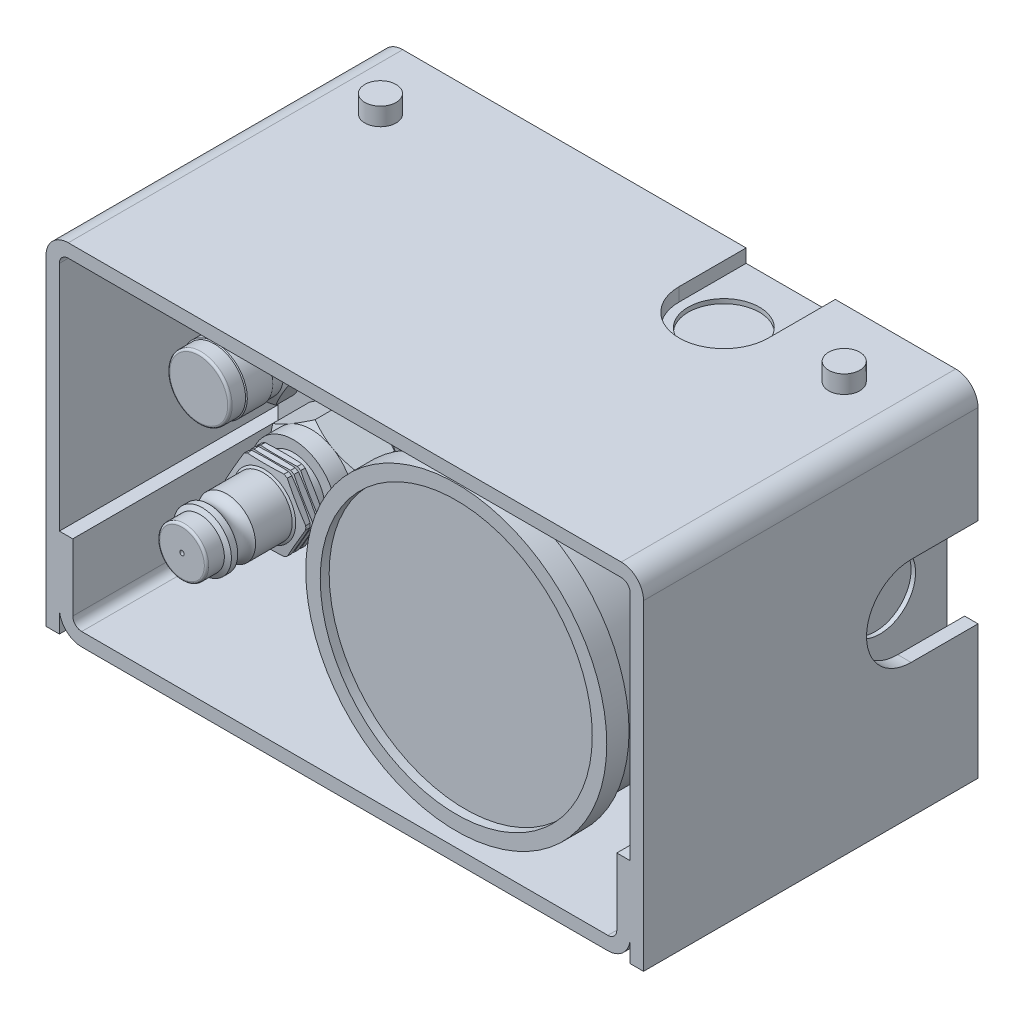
from build123d import *

# Parameters (mm, degrees)
SKETCH1_W           = 120
SKETCH1_H           = 68
SKETCH1_R           = 5.25
BOSS_EXTRUDE1_DEPTH = 15
SKETCH2_W           = 1
SKETCH2_H           = 8
SKETCH4_W           = 8
SKETCH4_H           = 1
SKETCH5_R           = 8.75
CUT_EXTRUDE1_DEPTH  = 12
SKETCH6_R           = 8
CUT_EXTRUDE2_DEPTH  = 1
BOSS_EXTRUDE2_DEPTH = 75
CUT_EXTRUDE3_DEPTH  = 3
CUT_EXTRUDE4_START  = -3
CUT_EXTRUDE4_DEPTH  = 3
CUT_EXTRUDE5_DEPTH  = 3
CUT_EXTRUDE6_START  = -3
CUT_EXTRUDE6_DEPTH  = 3
SKETCH16_R          = 12
CUT_EXTRUDE8_DEPTH  = 20
SKETCH17_R          = 12
CUT_EXTRUDE9_DEPTH  = 15
SKETCH19_R          = 11
CUT_EXTRUDE10_DEPTH = 0.5
SKETCH21_R          = 12.5
CUT_EXTRUDE11_DEPTH = 25
SKETCH22_R          = 16
CUT_EXTRUDE13_DEPTH = 39
SKETCH23_W          = 3.5
SKETCH23_H          = 4
SKETCH24_W          = 3.5
SKETCH24_H          = 4


with BuildPart() as part:
    # Sketch1 → Boss-Extrude1 (new, symmetric)
    with BuildSketch(Plane.XY):
        Rectangle(SKETCH1_W, SKETCH1_H)
        with Locations((-20, 19.5)):
            Circle(SKETCH1_R, mode=Mode.SUBTRACT)
        with Locations((-20, -19.5)):
            Circle(SKETCH1_R, mode=Mode.SUBTRACT)
    extrude(amount=BOSS_EXTRUDE1_DEPTH, both=True)

    # Sketch2 → Cut-Revolve1 (revolve, cut)
    with BuildSketch(Plane.XY, mode=Mode.PRIVATE) as cut_revolve1_sk:
        with Locations((-59.5, 4)):
            Rectangle(SKETCH2_W, SKETCH2_H)
        with Locations((59.5, 4)):
            Rectangle(SKETCH2_W, SKETCH2_H)
    revolve(cut_revolve1_sk.sketch.rotate(Axis((-64.964132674, 0, 0), (1, 0, 0)), 90), axis=Axis((-64.964132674, 0, 0), (1, 0, 0)), mode=Mode.SUBTRACT)

    # Sketch4 → Cut-Revolve2 (revolve, cut)
    with BuildSketch(Plane.XY, mode=Mode.PRIVATE) as cut_revolve2_sk:
        with Locations((29, 33.5)):
            Rectangle(SKETCH4_W, SKETCH4_H)
        with Locations((29, -33.5)):
            Rectangle(SKETCH4_W, SKETCH4_H)
    revolve(cut_revolve2_sk.sketch.rotate(Axis((25, 42.177718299, 0), (0, -1, 0)), 180), axis=Axis((25, 42.177718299, 0), (0, -1, 0)), mode=Mode.SUBTRACT)

    # Sketch5 → Cut-Extrude1 (cut)
    with BuildSketch(Plane.XY.offset(15)):
        with Locations((-20, 19.5)):
            Circle(SKETCH5_R)
        with Locations((-20, -19.5)):
            Circle(SKETCH5_R)
    extrude(amount=-CUT_EXTRUDE1_DEPTH, mode=Mode.SUBTRACT)

    # Sketch6 → Cut-Extrude2 (cut)
    with BuildSketch(Plane.XZ.offset(34)):
        with Locations(Location((-42, 0, 0), (0, 0, 270))):
            Circle(SKETCH6_R)
    extrude(amount=-CUT_EXTRUDE2_DEPTH, mode=Mode.SUBTRACT)

    # Sketch7 → Boss-Extrude2 (add)
    with BuildSketch(Plane(origin=(0, 0, -15), x_dir=(-1, 0, 0), z_dir=(0, 0, -1))):
        with BuildLine():
            Line((62, 37), (-62, 37))
            ThreePointArc((-62, 37), (-65.535533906, 35.535533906), (-67, 32))
            Line((-67, 32), (-67, -40))
            Line((-67, -40), (-64, -40))
            Line((-64, -40), (-64, -35))
            ThreePointArc((-64, -35), (-62.535533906, -38.535533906), (-59, -40))
            Line((-59, -40), (59, -40))
            ThreePointArc((59, -40), (62.535533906, -38.535533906), (64, -35))
            Line((64, -35), (64, -40))
            Line((64, -40), (67, -40))
            Line((67, -40), (67, 32))
            ThreePointArc((67, 32), (65.535533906, 35.535533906), (62, 37))
        make_face()
        with BuildLine():
            Line((62, 34), (-62, 34))
            ThreePointArc((-62, 34), (-63.414213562, 33.414213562), (-64, 32))
            Line((-64, 32), (-64, -20))
            Line((-64, -20), (-61, -20))
            Line((-61, -20), (-61, -35))
            ThreePointArc((-61, -35), (-60.414213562, -36.414213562), (-59, -37))
            Line((-59, -37), (59, -37))
            ThreePointArc((59, -37), (60.414213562, -36.414213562), (61, -35))
            Line((61, -35), (61, -20))
            Line((61, -20), (64, -20))
            Line((64, -20), (64, 32))
            ThreePointArc((64, 32), (63.414213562, 33.414213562), (62, 34))
        make_face(mode=Mode.SUBTRACT)
    extrude(amount=-BOSS_EXTRUDE2_DEPTH)

    # Sketch9 → Cut-Extrude3 (cut)
    with BuildSketch(Plane.XZ.offset(40)):
        with BuildLine():
            Line((15, 0), (15, -15))
            Line((15, -15), (35, -15))
            Line((35, -15), (35, 0))
            ThreePointArc((35, 0), (25, 10), (15, 0))
        make_face()
        with BuildLine():
            Line((-52, 0), (-52, -15))
            Line((-52, -15), (-32, -15))
            Line((-32, -15), (-32, 0))
            ThreePointArc((-32, 0), (-42, 10), (-52, 0))
        make_face()
    extrude(amount=-CUT_EXTRUDE3_DEPTH, mode=Mode.SUBTRACT)

    # Sketch10 → Cut-Extrude4 (cut)
    with BuildSketch(Plane(origin=(0, 37, 0), x_dir=(1, 0, 0), z_dir=(0, 1, 0)).offset(CUT_EXTRUDE4_START)):
        with BuildLine():
            Line((15, 15), (15, 0))
            ThreePointArc((15, 0), (25, -10), (35, 0))
            Line((35, 0), (35, 15))
            Line((35, 15), (15, 15))
        make_face()
    extrude(amount=CUT_EXTRUDE4_DEPTH, mode=Mode.SUBTRACT)

    # Sketch11 → Cut-Extrude5 (cut)
    with BuildSketch(Plane.ZY.offset(67)):
        with BuildLine():
            Line((0, 10), (-15, 10))
            Line((-15, 10), (-15, -10))
            Line((-15, -10), (0, -10))
            ThreePointArc((0, -10), (10, 0), (0, 10))
        make_face()
    extrude(amount=-CUT_EXTRUDE5_DEPTH, mode=Mode.SUBTRACT)

    # Sketch13 → Cut-Extrude6 (cut)
    with BuildSketch(Plane(origin=(67, 0, 0), x_dir=(0, 0, -1), z_dir=(1, 0, 0)).offset(CUT_EXTRUDE6_START)):
        with BuildLine():
            Line((0, 10), (15, 10))
            Line((15, 10), (15, -10))
            Line((15, -10), (0, -10))
            ThreePointArc((0, -10), (-10, 0), (0, 10))
        make_face()
    extrude(amount=CUT_EXTRUDE6_DEPTH, mode=Mode.SUBTRACT)

    # Sketch14 → Revolve2 (revolve)
    with BuildSketch(Plane.ZY.offset(-25), mode=Mode.PRIVATE) as revolve2_sk:
        with BuildLine():
            Line((55, 31.25), (33, 31.25))
            ThreePointArc((33, 31.25), (30.878679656, 30.371320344), (30, 28.25))
            Line((30, 28.25), (30, 8))
            Line((30, 8), (15, 8))
            Line((15, 8), (15, 0))
            Line((15, 0), (58, 0))
            Line((58, 0), (58, 30.5))
            Line((58, 30.5), (60, 30.5))
            Line((60, 30.5), (60, 33.75))
            Line((60, 33.75), (55, 33.75))
            Line((55, 33.75), (55, 31.25))
        make_face()
    revolve(revolve2_sk.sketch.rotate(Axis((25, 0, 15), (0, 0, 1)), 90), axis=Axis((25, 0, 15), (0, 0, 1)))

    # Sketch15 → Revolve3 (revolve)
    with BuildSketch(Plane.ZY.offset(42)):
        with BuildLine():
            Line((15, 14), (15, 21))
            Line((15, 21), (21, 21))
            Line((21, 21), (23.309401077, 25))
            Line((23.309401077, 25), (24.690598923, 25))
            Line((24.690598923, 25), (27, 21))
            Line((27, 21), (27, 19.5))
            Line((27, 19.5), (28, 20.5))
            Line((28, 20.5), (28.711324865, 20.5))
            Line((28.711324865, 20.5), (29, 21))
            Line((29, 21), (32.75, 21))
            Line((32.75, 21), (35.059401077, 25))
            Line((35.059401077, 25), (36.440598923, 25))
            Line((36.440598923, 25), (38.75, 21))
            Line((38.75, 21), (41.25, 21))
            Line((41.25, 21), (41.394337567, 21.25))
            Line((41.394337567, 21.25), (47.105662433, 21.25))
            Line((47.105662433, 21.25), (47.25, 21))
            Line((47.25, 21), (50.25, 21))
            ThreePointArc((50.25, 21), (50.603553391, 20.853553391), (50.75, 20.5))
            Line((50.75, 20.5), (50.75, 14))
            Line((50.75, 14), (15, 14))
        make_face()
    revolve(axis=Axis((-42, 14, 15), (0, 0, 1)))

    # Sketch16 → Cut-Extrude8 (cut)
    with BuildSketch(Plane.XY.offset(50.75)):
        with Locations((-42, 14)):
            Circle(SKETCH16_R)
        Polygon((-37.669872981, 6.5), (-33.339745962, 14), (-37.669872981, 21.5), (-46.330127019, 21.5), (-50.660254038, 14), (-46.330127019, 6.5), align=None, mode=Mode.SUBTRACT)
    extrude(amount=-CUT_EXTRUDE8_DEPTH, mode=Mode.SUBTRACT)

    # Sketch17 → Cut-Extrude9 (cut)
    with BuildSketch(Plane.XY.offset(15)):
        with Locations((-42, 14)):
            Circle(SKETCH17_R)
        Polygon((-42, 5.917096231), (-35, 9.958548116), (-35, 18.041451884), (-42, 22.082903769), (-49, 18.041451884), (-49, 9.958548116), align=None, mode=Mode.SUBTRACT)
    extrude(amount=CUT_EXTRUDE9_DEPTH, mode=Mode.SUBTRACT)

    # Sketch19 → Cut-Extrude10 (cut)
    with BuildSketch(Plane.XY.offset(15)):
        with Locations((-42, -16)):
            Circle(SKETCH19_R)
    extrude(amount=-CUT_EXTRUDE10_DEPTH, mode=Mode.SUBTRACT)

    # Sketch20 → Revolve4 (revolve)
    with BuildSketch(Plane.ZY.offset(42), mode=Mode.PRIVATE) as revolve4_sk:
        with BuildLine():
            Line((14.5, -16), (14.5, -6))
            Line((14.5, -6), (15.5, -6))
            Line((15.5, -6), (15.5, -6.5))
            Line((15.5, -6.5), (18.675426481, -1))
            Line((18.675426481, -1), (22.324573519, -1))
            Line((22.324573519, -1), (25.5, -6.5))
            Line((25.5, -6.5), (29.5, -6.5))
            Line((29.5, -6.5), (29.5, -9))
            Line((29.5, -9), (31.5, -9))
            Line((31.5, -9), (31.75, -7))
            Line((31.75, -7), (32.75, -7))
            Line((32.75, -7), (33, -9))
            Line((33, -9), (33.25, -7))
            Line((33.25, -7), (34.25, -7))
            Line((34.25, -7), (34.5, -9))
            Line((34.5, -9), (34.75, -7))
            Line((34.75, -7), (35.75, -7))
            Line((35.75, -7), (36, -9))
            Line((36, -9), (36.288675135, -9.5))
            Line((36.288675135, -9.5), (44.5, -9.5))
            ThreePointArc((44.5, -9.5), (46.5, -10.5), (48.5, -9.5))
            Line((48.5, -9.5), (49.922649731, -9.5))
            Line((49.922649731, -9.5), (50.5, -10.5))
            Line((50.5, -10.5), (54, -10.5))
            ThreePointArc((54, -10.5), (54.353553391, -10.646446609), (54.5, -11))
            Line((54.5, -11), (54.5, -15.5))
            Line((54.5, -15.5), (49.5, -15.5))
            Line((49.5, -15.5), (49.5, -16))
            Line((49.5, -16), (14.5, -16))
        make_face()
    revolve(revolve4_sk.sketch.rotate(Axis((-42, -16, 14.5), (0, 0, 1)), 90), axis=Axis((-42, -16, 14.5), (0, 0, 1)))

    # Sketch21 → Cut-Extrude11 (cut)
    with BuildSketch(Plane.XY.offset(54.5)):
        with Locations((-42, -16)):
            Circle(SKETCH21_R)
        Polygon((-32.762395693, -16), (-37.381197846, -8), (-46.618802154, -8), (-51.237604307, -16), (-46.618802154, -24), (-37.381197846, -24), align=None, mode=Mode.SUBTRACT)
    extrude(amount=-CUT_EXTRUDE11_DEPTH, mode=Mode.SUBTRACT)

    # Sketch22 → Cut-Extrude13 (cut)
    with BuildSketch(Plane.XY.offset(54.5)):
        with Locations((-42, -16)):
            Circle(SKETCH22_R)
        Polygon((-42, -26.969655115), (-32.5, -21.484827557), (-32.5, -10.515172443), (-42, -5.030344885), (-51.5, -10.515172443), (-51.5, -21.484827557), align=None, mode=Mode.SUBTRACT)
    extrude(amount=-CUT_EXTRUDE13_DEPTH, mode=Mode.SUBTRACT)

    # Sketch23 → Revolve5 (revolve)
    with BuildSketch(Plane.XY, mode=Mode.PRIVATE) as revolve5_sk:
        with Locations((-53.75, 39)):
            Rectangle(SKETCH23_W, SKETCH23_H)
    revolve(revolve5_sk.sketch.rotate(Axis((-52, 37, 0), (0, 1, 0)), 270), axis=Axis((-52, 37, 0), (0, 1, 0)))

    # Sketch24 → Revolve6 (revolve)
    with BuildSketch(Plane.XY, mode=Mode.PRIVATE) as revolve6_sk:
        with Locations((53.75, 39)):
            Rectangle(SKETCH24_W, SKETCH24_H)
    revolve(revolve6_sk.sketch.rotate(Axis((52, 37, 0), (0, 1, 0)), 90), axis=Axis((52, 37, 0), (0, 1, 0)))


solid = part.part
